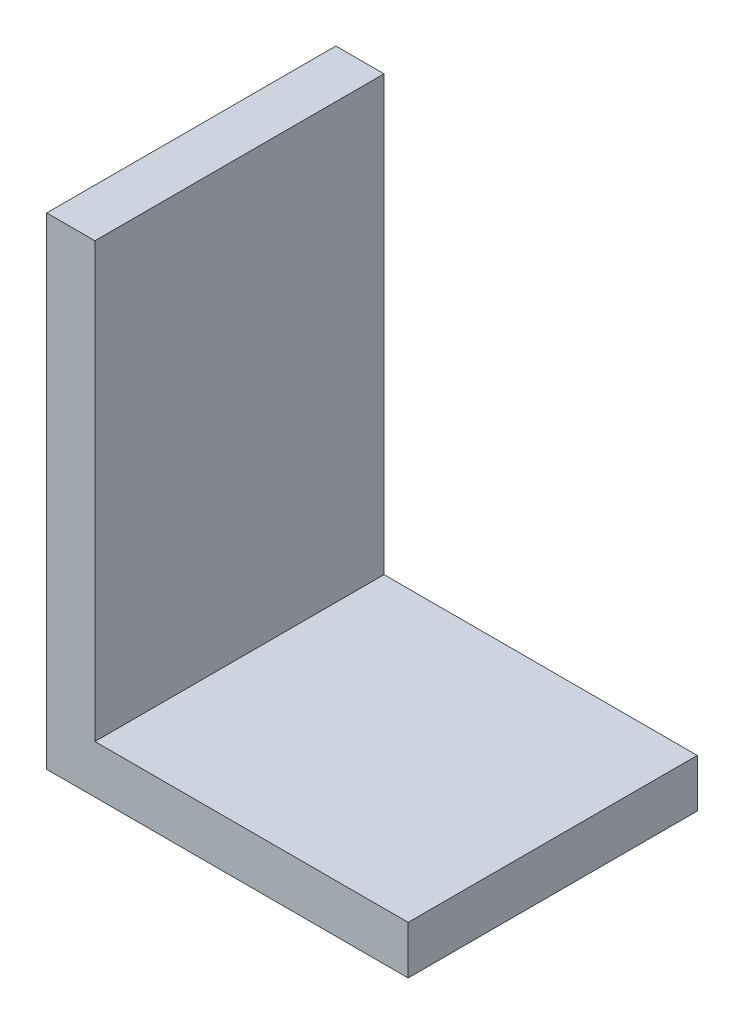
ISO-10303-21;
HEADER;
FILE_DESCRIPTION(('STEP AP214'),'2;1');
FILE_NAME('part.step','',(''),(''),'','','');
FILE_SCHEMA(('AUTOMOTIVE_DESIGN { 1 0 10303 214 1 1 1 1 }'));
ENDSEC;
DATA;
#1=APPLICATION_CONTEXT('core data for automotive mechanical design processes');
#2=APPLICATION_PROTOCOL_DEFINITION('international standard','automotive_design',2000,#1);
#3=PRODUCT_CONTEXT('',#1,'mechanical');
#4=PRODUCT('Part','Part','',(#3));
#5=PRODUCT_RELATED_PRODUCT_CATEGORY('part','',(#4));
#6=PRODUCT_DEFINITION_FORMATION('','',#4);
#7=PRODUCT_DEFINITION_CONTEXT('part definition',#1,'design');
#8=PRODUCT_DEFINITION('design','',#6,#7);
#9=PRODUCT_DEFINITION_SHAPE('','',#8);
#10=(LENGTH_UNIT() NAMED_UNIT(*) SI_UNIT(.MILLI.,.METRE.));
#11=(NAMED_UNIT(*) PLANE_ANGLE_UNIT() SI_UNIT($,.RADIAN.));
#12=(NAMED_UNIT(*) SI_UNIT($,.STERADIAN.) SOLID_ANGLE_UNIT());
#13=UNCERTAINTY_MEASURE_WITH_UNIT(LENGTH_MEASURE(1.E-05),#10,'distance_accuracy_value','');
#14=(GEOMETRIC_REPRESENTATION_CONTEXT(3) GLOBAL_UNCERTAINTY_ASSIGNED_CONTEXT((#13)) GLOBAL_UNIT_ASSIGNED_CONTEXT((#10,
#11,#12)) REPRESENTATION_CONTEXT('',''));
#15=CARTESIAN_POINT('',(0.,0.,0.));
#16=DIRECTION('',(0.,0.,1.));
#17=DIRECTION('',(1.,0.,0.));
#18=AXIS2_PLACEMENT_3D('',#15,#16,#17);
#19=CARTESIAN_POINT('',(0.,0.,30.));
#20=DIRECTION('',(0.,1.,0.));
#21=DIRECTION('',(0.,0.,1.));
#22=AXIS2_PLACEMENT_3D('',#19,#20,#21);
#23=PLANE('',#22);
#24=DIRECTION('',(1.,0.,0.));
#25=VECTOR('',#24,1.);
#26=CARTESIAN_POINT('',(0.,0.,-30.));
#27=LINE('',#26,#25);
#28=CARTESIAN_POINT('',(0.,0.,-30.));
#29=VERTEX_POINT('',#28);
#30=CARTESIAN_POINT('',(75.,0.,-30.));
#31=VERTEX_POINT('',#30);
#32=EDGE_CURVE('E96',#29,#31,#27,.T.);
#33=ORIENTED_EDGE('',*,*,#32,.T.);
#34=DIRECTION('',(0.,0.,-1.));
#35=VECTOR('',#34,1.);
#36=CARTESIAN_POINT('',(75.,0.,30.));
#37=LINE('',#36,#35);
#38=CARTESIAN_POINT('',(75.,0.,30.));
#39=VERTEX_POINT('',#38);
#40=EDGE_CURVE('E11',#39,#31,#37,.T.);
#41=ORIENTED_EDGE('',*,*,#40,.F.);
#42=DIRECTION('',(1.,0.,0.));
#43=VECTOR('',#42,1.);
#44=CARTESIAN_POINT('',(0.,0.,30.));
#45=LINE('',#44,#43);
#46=CARTESIAN_POINT('',(0.,0.,30.));
#47=VERTEX_POINT('',#46);
#48=EDGE_CURVE('E115',#47,#39,#45,.T.);
#49=ORIENTED_EDGE('',*,*,#48,.F.);
#50=DIRECTION('',(0.,0.,-1.));
#51=VECTOR('',#50,1.);
#52=CARTESIAN_POINT('',(0.,0.,30.));
#53=LINE('',#52,#51);
#54=EDGE_CURVE('E97',#47,#29,#53,.T.);
#55=ORIENTED_EDGE('',*,*,#54,.T.);
#56=EDGE_LOOP('',(#33,#41,#49,#55));
#57=FACE_BOUND('',#56,.T.);
#58=ADVANCED_FACE('F32',(#57),#23,.F.);
#59=CARTESIAN_POINT('',(75.,10.,30.));
#60=DIRECTION('',(1.,0.,0.));
#61=DIRECTION('',(0.,0.,-1.));
#62=AXIS2_PLACEMENT_3D('',#59,#60,#61);
#63=PLANE('',#62);
#64=DIRECTION('',(0.,-1.,0.));
#65=VECTOR('',#64,1.);
#66=CARTESIAN_POINT('',(75.,10.,-30.));
#67=LINE('',#66,#65);
#68=CARTESIAN_POINT('',(75.,10.,-30.));
#69=VERTEX_POINT('',#68);
#70=EDGE_CURVE('E88',#69,#31,#67,.T.);
#71=ORIENTED_EDGE('',*,*,#70,.F.);
#72=DIRECTION('',(0.,0.,-1.));
#73=VECTOR('',#72,1.);
#74=CARTESIAN_POINT('',(75.,10.,30.));
#75=LINE('',#74,#73);
#76=CARTESIAN_POINT('',(75.,10.,30.));
#77=VERTEX_POINT('',#76);
#78=EDGE_CURVE('E39',#77,#69,#75,.T.);
#79=ORIENTED_EDGE('',*,*,#78,.F.);
#80=DIRECTION('',(0.,-1.,0.));
#81=VECTOR('',#80,1.);
#82=CARTESIAN_POINT('',(75.,10.,30.));
#83=LINE('',#82,#81);
#84=EDGE_CURVE('E91',#77,#39,#83,.T.);
#85=ORIENTED_EDGE('',*,*,#84,.T.);
#86=ORIENTED_EDGE('',*,*,#40,.T.);
#87=EDGE_LOOP('',(#71,#79,#85,#86));
#88=FACE_BOUND('',#87,.T.);
#89=ADVANCED_FACE('F86',(#88),#63,.T.);
#90=CARTESIAN_POINT('',(0.,10.,30.));
#91=DIRECTION('',(0.,1.,0.));
#92=DIRECTION('',(0.,0.,1.));
#93=AXIS2_PLACEMENT_3D('',#90,#91,#92);
#94=PLANE('',#93);
#95=DIRECTION('',(1.,0.,0.));
#96=VECTOR('',#95,1.);
#97=CARTESIAN_POINT('',(0.,10.,-30.));
#98=LINE('',#97,#96);
#99=CARTESIAN_POINT('',(10.,10.,-30.));
#100=VERTEX_POINT('',#99);
#101=EDGE_CURVE('E104',#100,#69,#98,.T.);
#102=ORIENTED_EDGE('',*,*,#101,.F.);
#103=DIRECTION('',(0.,0.,-1.));
#104=VECTOR('',#103,1.);
#105=CARTESIAN_POINT('',(10.,10.,30.));
#106=LINE('',#105,#104);
#107=CARTESIAN_POINT('',(10.,10.,30.));
#108=VERTEX_POINT('',#107);
#109=EDGE_CURVE('E131',#108,#100,#106,.T.);
#110=ORIENTED_EDGE('',*,*,#109,.F.);
#111=DIRECTION('',(1.,0.,0.));
#112=VECTOR('',#111,1.);
#113=CARTESIAN_POINT('',(0.,10.,30.));
#114=LINE('',#113,#112);
#115=EDGE_CURVE('E118',#108,#77,#114,.T.);
#116=ORIENTED_EDGE('',*,*,#115,.T.);
#117=ORIENTED_EDGE('',*,*,#78,.T.);
#118=EDGE_LOOP('',(#102,#110,#116,#117));
#119=FACE_BOUND('',#118,.T.);
#120=ADVANCED_FACE('F133',(#119),#94,.T.);
#121=CARTESIAN_POINT('',(10.,100.,30.));
#122=DIRECTION('',(1.,0.,0.));
#123=DIRECTION('',(0.,1.,0.));
#124=AXIS2_PLACEMENT_3D('',#121,#122,#123);
#125=PLANE('',#124);
#126=DIRECTION('',(0.,-1.,0.));
#127=VECTOR('',#126,1.);
#128=CARTESIAN_POINT('',(10.,100.,-30.));
#129=LINE('',#128,#127);
#130=CARTESIAN_POINT('',(10.,100.,-30.));
#131=VERTEX_POINT('',#130);
#132=EDGE_CURVE('E106',#131,#100,#129,.T.);
#133=ORIENTED_EDGE('',*,*,#132,.F.);
#134=DIRECTION('',(0.,0.,-1.));
#135=VECTOR('',#134,1.);
#136=CARTESIAN_POINT('',(10.,100.,30.));
#137=LINE('',#136,#135);
#138=CARTESIAN_POINT('',(10.,100.,30.));
#139=VERTEX_POINT('',#138);
#140=EDGE_CURVE('E129',#139,#131,#137,.T.);
#141=ORIENTED_EDGE('',*,*,#140,.F.);
#142=DIRECTION('',(0.,-1.,0.));
#143=VECTOR('',#142,1.);
#144=CARTESIAN_POINT('',(10.,100.,30.));
#145=LINE('',#144,#143);
#146=EDGE_CURVE('E121',#139,#108,#145,.T.);
#147=ORIENTED_EDGE('',*,*,#146,.T.);
#148=ORIENTED_EDGE('',*,*,#109,.T.);
#149=EDGE_LOOP('',(#133,#141,#147,#148));
#150=FACE_BOUND('',#149,.T.);
#151=ADVANCED_FACE('F139',(#150),#125,.T.);
#152=CARTESIAN_POINT('',(0.,100.,30.));
#153=DIRECTION('',(0.,1.,0.));
#154=DIRECTION('',(0.,0.,1.));
#155=AXIS2_PLACEMENT_3D('',#152,#153,#154);
#156=PLANE('',#155);
#157=DIRECTION('',(1.,0.,0.));
#158=VECTOR('',#157,1.);
#159=CARTESIAN_POINT('',(0.,100.,-30.));
#160=LINE('',#159,#158);
#161=CARTESIAN_POINT('',(0.,100.,-30.));
#162=VERTEX_POINT('',#161);
#163=EDGE_CURVE('E110',#162,#131,#160,.T.);
#164=ORIENTED_EDGE('',*,*,#163,.F.);
#165=DIRECTION('',(0.,0.,-1.));
#166=VECTOR('',#165,1.);
#167=CARTESIAN_POINT('',(0.,100.,30.));
#168=LINE('',#167,#166);
#169=CARTESIAN_POINT('',(0.,100.,30.));
#170=VERTEX_POINT('',#169);
#171=EDGE_CURVE('E54',#170,#162,#168,.T.);
#172=ORIENTED_EDGE('',*,*,#171,.F.);
#173=DIRECTION('',(1.,0.,0.));
#174=VECTOR('',#173,1.);
#175=CARTESIAN_POINT('',(0.,100.,30.));
#176=LINE('',#175,#174);
#177=EDGE_CURVE('E124',#170,#139,#176,.T.);
#178=ORIENTED_EDGE('',*,*,#177,.T.);
#179=ORIENTED_EDGE('',*,*,#140,.T.);
#180=EDGE_LOOP('',(#164,#172,#178,#179));
#181=FACE_BOUND('',#180,.T.);
#182=ADVANCED_FACE('F140',(#181),#156,.T.);
#183=CARTESIAN_POINT('',(0.,100.,30.));
#184=DIRECTION('',(1.,0.,0.));
#185=DIRECTION('',(0.,1.,0.));
#186=AXIS2_PLACEMENT_3D('',#183,#184,#185);
#187=PLANE('',#186);
#188=DIRECTION('',(0.,-1.,0.));
#189=VECTOR('',#188,1.);
#190=CARTESIAN_POINT('',(0.,100.,-30.));
#191=LINE('',#190,#189);
#192=EDGE_CURVE('E113',#162,#29,#191,.T.);
#193=ORIENTED_EDGE('',*,*,#192,.T.);
#194=ORIENTED_EDGE('',*,*,#54,.F.);
#195=DIRECTION('',(0.,-1.,0.));
#196=VECTOR('',#195,1.);
#197=CARTESIAN_POINT('',(0.,100.,30.));
#198=LINE('',#197,#196);
#199=EDGE_CURVE('E46',#170,#47,#198,.T.);
#200=ORIENTED_EDGE('',*,*,#199,.F.);
#201=ORIENTED_EDGE('',*,*,#171,.T.);
#202=EDGE_LOOP('',(#193,#194,#200,#201));
#203=FACE_BOUND('',#202,.T.);
#204=ADVANCED_FACE('F142',(#203),#187,.F.);
#205=CARTESIAN_POINT('',(75.,0.,30.));
#206=DIRECTION('',(0.,0.,-1.));
#207=DIRECTION('',(-1.,0.,0.));
#208=AXIS2_PLACEMENT_3D('',#205,#206,#207);
#209=PLANE('',#208);
#210=ORIENTED_EDGE('',*,*,#48,.T.);
#211=ORIENTED_EDGE('',*,*,#84,.F.);
#212=ORIENTED_EDGE('',*,*,#115,.F.);
#213=ORIENTED_EDGE('',*,*,#146,.F.);
#214=ORIENTED_EDGE('',*,*,#177,.F.);
#215=ORIENTED_EDGE('',*,*,#199,.T.);
#216=EDGE_LOOP('',(#210,#211,#212,#213,#214,#215));
#217=FACE_BOUND('',#216,.T.);
#218=ADVANCED_FACE('F135',(#217),#209,.F.);
#219=CARTESIAN_POINT('',(75.,0.,-30.));
#220=DIRECTION('',(0.,0.,-1.));
#221=DIRECTION('',(-1.,0.,0.));
#222=AXIS2_PLACEMENT_3D('',#219,#220,#221);
#223=PLANE('',#222);
#224=ORIENTED_EDGE('',*,*,#32,.F.);
#225=ORIENTED_EDGE('',*,*,#192,.F.);
#226=ORIENTED_EDGE('',*,*,#163,.T.);
#227=ORIENTED_EDGE('',*,*,#132,.T.);
#228=ORIENTED_EDGE('',*,*,#101,.T.);
#229=ORIENTED_EDGE('',*,*,#70,.T.);
#230=EDGE_LOOP('',(#224,#225,#226,#227,#228,#229));
#231=FACE_BOUND('',#230,.T.);
#232=ADVANCED_FACE('F101',(#231),#223,.T.);
#233=CLOSED_SHELL('',(#58,#89,#120,#151,#182,#204,#218,#232));
#234=MANIFOLD_SOLID_BREP('B2',#233);
#235=ADVANCED_BREP_SHAPE_REPRESENTATION('',(#18,#234),#14);
#236=SHAPE_DEFINITION_REPRESENTATION(#9,#235);
ENDSEC;
END-ISO-10303-21;
